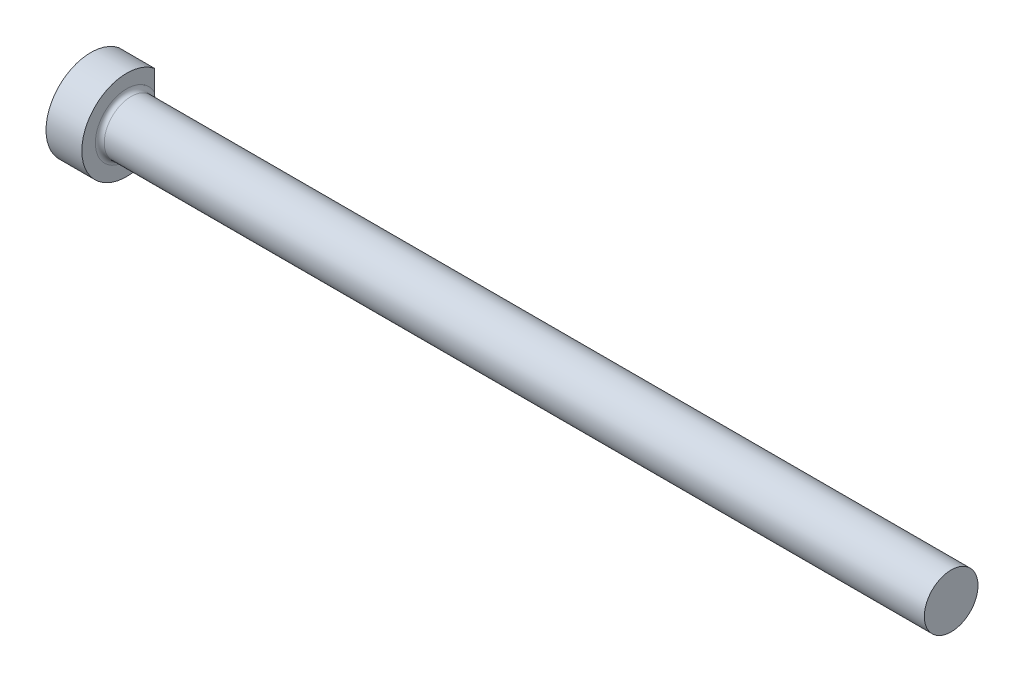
ISO-10303-21;
HEADER;
FILE_DESCRIPTION(('STEP AP214'),'2;1');
FILE_NAME('part.step','',(''),(''),'','','');
FILE_SCHEMA(('AUTOMOTIVE_DESIGN { 1 0 10303 214 1 1 1 1 }'));
ENDSEC;
DATA;
#1=APPLICATION_CONTEXT('core data for automotive mechanical design processes');
#2=APPLICATION_PROTOCOL_DEFINITION('international standard','automotive_design',2000,#1);
#3=PRODUCT_CONTEXT('',#1,'mechanical');
#4=PRODUCT('Part','Part','',(#3));
#5=PRODUCT_RELATED_PRODUCT_CATEGORY('part','',(#4));
#6=PRODUCT_DEFINITION_FORMATION('','',#4);
#7=PRODUCT_DEFINITION_CONTEXT('part definition',#1,'design');
#8=PRODUCT_DEFINITION('design','',#6,#7);
#9=PRODUCT_DEFINITION_SHAPE('','',#8);
#10=(LENGTH_UNIT() NAMED_UNIT(*) SI_UNIT(.MILLI.,.METRE.));
#11=(NAMED_UNIT(*) PLANE_ANGLE_UNIT() SI_UNIT($,.RADIAN.));
#12=(NAMED_UNIT(*) SI_UNIT($,.STERADIAN.) SOLID_ANGLE_UNIT());
#13=UNCERTAINTY_MEASURE_WITH_UNIT(LENGTH_MEASURE(1.E-05),#10,'distance_accuracy_value','');
#14=(GEOMETRIC_REPRESENTATION_CONTEXT(3) GLOBAL_UNCERTAINTY_ASSIGNED_CONTEXT((#13)) GLOBAL_UNIT_ASSIGNED_CONTEXT((#10,
#11,#12)) REPRESENTATION_CONTEXT('',''));
#15=CARTESIAN_POINT('',(0.,0.,0.));
#16=DIRECTION('',(0.,0.,1.));
#17=DIRECTION('',(1.,0.,0.));
#18=AXIS2_PLACEMENT_3D('',#15,#16,#17);
#19=CARTESIAN_POINT('',(0.,0.,0.));
#20=DIRECTION('',(1.,0.,0.));
#21=DIRECTION('',(0.,1.,0.));
#22=AXIS2_PLACEMENT_3D('',#19,#20,#21);
#23=PLANE('',#22);
#24=DIRECTION('',(0.,1.,0.));
#25=VECTOR('',#24,1.);
#26=CARTESIAN_POINT('',(0.,0.,-4.93395000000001));
#27=LINE('',#26,#25);
#28=CARTESIAN_POINT('',(0.,-6.21772013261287,-4.93395000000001));
#29=VERTEX_POINT('',#28);
#30=CARTESIAN_POINT('',(0.,6.21772013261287,-4.93395));
#31=VERTEX_POINT('',#30);
#32=EDGE_CURVE('E49',#29,#31,#27,.T.);
#33=ORIENTED_EDGE('',*,*,#32,.F.);
#34=CARTESIAN_POINT('',(0.,0.,0.));
#35=DIRECTION('',(-1.,0.,0.));
#36=DIRECTION('',(0.,-1.,0.));
#37=AXIS2_PLACEMENT_3D('',#34,#35,#36);
#38=CIRCLE('',#37,7.93749999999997);
#39=EDGE_CURVE('E43',#29,#31,#38,.T.);
#40=ORIENTED_EDGE('',*,*,#39,.T.);
#41=EDGE_LOOP('',(#33,#40));
#42=FACE_BOUND('',#41,.T.);
#43=ADVANCED_FACE('F32',(#42),#23,.F.);
#44=CARTESIAN_POINT('',(152.4,0.,0.));
#45=DIRECTION('',(-1.,0.,0.));
#46=DIRECTION('',(0.,-1.,0.));
#47=AXIS2_PLACEMENT_3D('',#44,#45,#46);
#48=CYLINDRICAL_SURFACE('',#47,7.93749999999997);
#49=DIRECTION('',(-1.,0.,0.));
#50=VECTOR('',#49,1.);
#51=CARTESIAN_POINT('',(152.4,-6.21772013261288,-4.93395000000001));
#52=LINE('',#51,#50);
#53=CARTESIAN_POINT('',(6.34999999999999,-6.21772013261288,-4.93395000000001));
#54=VERTEX_POINT('',#53);
#55=EDGE_CURVE('E87',#54,#29,#52,.T.);
#56=ORIENTED_EDGE('',*,*,#55,.F.);
#57=CARTESIAN_POINT('',(6.34999999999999,0.,0.));
#58=DIRECTION('',(-1.,0.,0.));
#59=DIRECTION('',(0.,-1.,0.));
#60=AXIS2_PLACEMENT_3D('',#57,#58,#59);
#61=CIRCLE('',#60,7.93749999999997);
#62=CARTESIAN_POINT('',(6.35,6.21772013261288,-4.93395));
#63=VERTEX_POINT('',#62);
#64=EDGE_CURVE('E75',#54,#63,#61,.T.);
#65=ORIENTED_EDGE('',*,*,#64,.T.);
#66=DIRECTION('',(-1.,0.,0.));
#67=VECTOR('',#66,1.);
#68=CARTESIAN_POINT('',(152.4,6.21772013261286,-4.93395));
#69=LINE('',#68,#67);
#70=EDGE_CURVE('E56',#31,#63,#69,.F.);
#71=ORIENTED_EDGE('',*,*,#70,.F.);
#72=ORIENTED_EDGE('',*,*,#39,.F.);
#73=EDGE_LOOP('',(#56,#65,#71,#72));
#74=FACE_BOUND('',#73,.T.);
#75=ADVANCED_FACE('F97',(#74),#48,.T.);
#76=CARTESIAN_POINT('',(6.35,7.93749999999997,0.));
#77=DIRECTION('',(-1.,0.,0.));
#78=DIRECTION('',(0.,-1.,0.));
#79=AXIS2_PLACEMENT_3D('',#76,#77,#78);
#80=PLANE('',#79);
#81=DIRECTION('',(0.,-1.,0.));
#82=VECTOR('',#81,1.);
#83=CARTESIAN_POINT('',(6.35,7.93749999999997,-4.93395));
#84=LINE('',#83,#82);
#85=CARTESIAN_POINT('',(6.34999999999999,2.5272680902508,-4.93395));
#86=VERTEX_POINT('',#85);
#87=EDGE_CURVE('E84',#63,#86,#84,.T.);
#88=ORIENTED_EDGE('',*,*,#87,.F.);
#89=ORIENTED_EDGE('',*,*,#64,.F.);
#90=CARTESIAN_POINT('',(6.35,-2.5272680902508,-4.93395000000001));
#91=VERTEX_POINT('',#90);
#92=EDGE_CURVE('E80',#91,#54,#84,.T.);
#93=ORIENTED_EDGE('',*,*,#92,.F.);
#94=CARTESIAN_POINT('',(6.34999999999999,0.,0.));
#95=DIRECTION('',(-1.,0.,0.));
#96=DIRECTION('',(0.,-1.,0.));
#97=AXIS2_PLACEMENT_3D('',#94,#95,#96);
#98=CIRCLE('',#97,5.54355);
#99=EDGE_CURVE('E70',#91,#86,#98,.T.);
#100=ORIENTED_EDGE('',*,*,#99,.T.);
#101=EDGE_LOOP('',(#88,#89,#93,#100));
#102=FACE_BOUND('',#101,.T.);
#103=ADVANCED_FACE('F81',(#102),#80,.F.);
#104=CARTESIAN_POINT('',(7.1374,0.,0.));
#105=DIRECTION('',(-1.,0.,0.));
#106=DIRECTION('',(0.,-1.,0.));
#107=AXIS2_PLACEMENT_3D('',#104,#105,#106);
#108=TOROIDAL_SURFACE('',#107,5.54355,0.7874);
#109=CARTESIAN_POINT('',(7.13739999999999,0.,0.));
#110=DIRECTION('',(-1.,0.,0.));
#111=DIRECTION('',(0.,-1.,0.));
#112=AXIS2_PLACEMENT_3D('',#109,#110,#111);
#113=CIRCLE('',#112,4.75615);
#114=CARTESIAN_POINT('',(7.13739999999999,-4.75615,0.));
#115=VERTEX_POINT('',#114);
#116=EDGE_CURVE('E76',#115,#115,#113,.T.);
#117=ORIENTED_EDGE('',*,*,#116,.T.);
#118=EDGE_LOOP('',(#117));
#119=FACE_BOUND('',#118,.T.);
#120=CARTESIAN_POINT('',(6.63901601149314,0.,-4.93395000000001));
#121=CARTESIAN_POINT('',(6.63901573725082,-0.0655924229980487,-4.93395000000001));
#122=CARTESIAN_POINT('',(6.63740024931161,-0.131185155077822,-4.93395000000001));
#123=CARTESIAN_POINT('',(6.63111964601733,-0.262224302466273,-4.93395000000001));
#124=CARTESIAN_POINT('',(6.6264543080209,-0.327670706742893,-4.93395000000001));
#125=CARTESIAN_POINT('',(6.60854776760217,-0.52384647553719,-4.93395000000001));
#126=CARTESIAN_POINT('',(6.59139845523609,-0.654205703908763,-4.93395000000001));
#127=CARTESIAN_POINT('',(6.55160775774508,-0.916304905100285,-4.93395000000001));
#128=CARTESIAN_POINT('',(6.52887607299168,-1.04802948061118,-4.93395000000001));
#129=CARTESIAN_POINT('',(6.4832326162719,-1.31132435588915,-4.93395000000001));
#130=CARTESIAN_POINT('',(6.46032103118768,-1.44289468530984,-4.93395000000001));
#131=CARTESIAN_POINT('',(6.41831019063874,-1.7075347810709,-4.93395000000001));
#132=CARTESIAN_POINT('',(6.39923581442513,-1.84060877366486,-4.93395000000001));
#133=CARTESIAN_POINT('',(6.36899641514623,-2.10794491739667,-4.93395000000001));
#134=CARTESIAN_POINT('',(6.35784503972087,-2.24220871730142,-4.93395000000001));
#135=CARTESIAN_POINT('',(6.34793677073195,-2.50930789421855,-4.93395000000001));
#136=CARTESIAN_POINT('',(6.34898926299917,-2.64213288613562,-4.93395000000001));
#137=CARTESIAN_POINT('',(6.36358073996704,-2.84022255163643,-4.93395000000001));
#138=CARTESIAN_POINT('',(6.3705931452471,-2.90596342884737,-4.93395000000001));
#139=CARTESIAN_POINT('',(6.3898258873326,-3.03666081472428,-4.93395000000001));
#140=CARTESIAN_POINT('',(6.40204140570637,-3.10161799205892,-4.93395000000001));
#141=CARTESIAN_POINT('',(6.42561983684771,-3.20023654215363,-4.93395000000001));
#142=CARTESIAN_POINT('',(6.43474813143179,-3.23443338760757,-4.93395000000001));
#143=CARTESIAN_POINT('',(6.455006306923,-3.30223001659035,-4.93395000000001));
#144=CARTESIAN_POINT('',(6.46613664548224,-3.33582966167,-4.93395000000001));
#145=CARTESIAN_POINT('',(6.50286270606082,-3.43544522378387,-4.93395000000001));
#146=CARTESIAN_POINT('',(6.53180356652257,-3.50032283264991,-4.93395000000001));
#147=CARTESIAN_POINT('',(6.58966480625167,-3.60450577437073,-4.93395000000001));
#148=CARTESIAN_POINT('',(6.61569797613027,-3.64541034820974,-4.93395000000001));
#149=CARTESIAN_POINT('',(6.67353108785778,-3.72295892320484,-4.93395000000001));
#150=CARTESIAN_POINT('',(6.70532160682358,-3.7596097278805,-4.93395000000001));
#151=CARTESIAN_POINT('',(6.76578876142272,-3.81756907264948,-4.93395000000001));
#152=CARTESIAN_POINT('',(6.79303425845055,-3.84036234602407,-4.93395000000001));
#153=CARTESIAN_POINT('',(6.85080647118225,-3.88134722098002,-4.93395000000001));
#154=CARTESIAN_POINT('',(6.88132865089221,-3.89954506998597,-4.93395000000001));
#155=CARTESIAN_POINT('',(6.93980418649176,-3.92748117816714,-4.93395000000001));
#156=CARTESIAN_POINT('',(6.96732026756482,-3.93812925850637,-4.93395000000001));
#157=CARTESIAN_POINT('',(7.02375341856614,-3.95467346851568,-4.93395000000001));
#158=CARTESIAN_POINT('',(7.05266962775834,-3.96057247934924,-4.93395000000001));
#159=CARTESIAN_POINT('',(7.1112000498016,-3.96717707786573,-4.93395000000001));
#160=CARTESIAN_POINT('',(7.14081633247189,-3.96786461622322,-4.93395000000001));
#161=CARTESIAN_POINT('',(7.19969379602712,-3.96394043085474,-4.93395000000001));
#162=CARTESIAN_POINT('',(7.22895493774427,-3.95932812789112,-4.93395000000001));
#163=CARTESIAN_POINT('',(7.28475066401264,-3.94554575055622,-4.93395000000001));
#164=CARTESIAN_POINT('',(7.31134794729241,-3.93662450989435,-4.93395000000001));
#165=CARTESIAN_POINT('',(7.36289955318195,-3.91491589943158,-4.93395000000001));
#166=CARTESIAN_POINT('',(7.38785326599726,-3.90212710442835,-4.93395000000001));
#167=CARTESIAN_POINT('',(7.44611804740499,-3.86711906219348,-4.93395000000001));
#168=CARTESIAN_POINT('',(7.47841331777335,-3.8432088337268,-4.93395000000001));
#169=CARTESIAN_POINT('',(7.53874770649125,-3.7905186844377,-4.93395000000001));
#170=CARTESIAN_POINT('',(7.56677713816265,-3.76172798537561,-4.93395000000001));
#171=CARTESIAN_POINT('',(7.6314899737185,-3.6856803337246,-4.93395000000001));
#172=CARTESIAN_POINT('',(7.6656618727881,-3.63629902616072,-4.93395000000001));
#173=CARTESIAN_POINT('',(7.72605933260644,-3.53294055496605,-4.93395000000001));
#174=CARTESIAN_POINT('',(7.75226856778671,-3.47895423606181,-4.93395000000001));
#175=CARTESIAN_POINT('',(7.79467798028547,-3.37622762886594,-4.93395000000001));
#176=CARTESIAN_POINT('',(7.81177536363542,-3.32784877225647,-4.93395000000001));
#177=CARTESIAN_POINT('',(7.84173487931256,-3.22978212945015,-4.93395000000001));
#178=CARTESIAN_POINT('',(7.85459383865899,-3.18009339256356,-4.93395000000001));
#179=CARTESIAN_POINT('',(7.88772653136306,-3.02973796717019,-4.93395000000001));
#180=CARTESIAN_POINT('',(7.90252562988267,-2.92786262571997,-4.93395000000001));
#181=CARTESIAN_POINT('',(7.92021387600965,-2.73389814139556,-4.93395000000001));
#182=CARTESIAN_POINT('',(7.92417788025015,-2.64188834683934,-4.93395000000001));
#183=CARTESIAN_POINT('',(7.92528678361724,-2.45777432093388,-4.93395000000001));
#184=CARTESIAN_POINT('',(7.92242611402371,-2.36567007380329,-4.93395000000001));
#185=CARTESIAN_POINT('',(7.91146162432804,-2.18153550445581,-4.93395000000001));
#186=CARTESIAN_POINT('',(7.90334239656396,-2.08950619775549,-4.93395000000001));
#187=CARTESIAN_POINT('',(7.88324256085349,-1.90592934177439,-4.93395000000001));
#188=CARTESIAN_POINT('',(7.87126371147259,-1.81438159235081,-4.93395000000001));
#189=CARTESIAN_POINT('',(7.83905908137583,-1.59263852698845,-4.93395000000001));
#190=CARTESIAN_POINT('',(7.81749654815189,-1.46264436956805,-4.93395000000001));
#191=CARTESIAN_POINT('',(7.77291274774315,-1.20282880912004,-4.93395000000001));
#192=CARTESIAN_POINT('',(7.74989035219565,-1.07300762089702,-4.93395000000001));
#193=CARTESIAN_POINT('',(7.70707425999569,-0.813855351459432,-4.93395000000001));
#194=CARTESIAN_POINT('',(7.68725589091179,-0.684528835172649,-4.93395000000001));
#195=CARTESIAN_POINT('',(7.66370485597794,-0.48984019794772,-4.93395000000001));
#196=CARTESIAN_POINT('',(7.65688618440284,-0.424866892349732,-4.93395000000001));
#197=CARTESIAN_POINT('',(7.64589614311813,-0.29470093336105,-4.93395000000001));
#198=CARTESIAN_POINT('',(7.64172448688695,-0.229508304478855,-4.93395000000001));
#199=CARTESIAN_POINT('',(7.6348470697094,-0.0579455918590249,-4.93395000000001));
#200=CARTESIAN_POINT('',(7.63471191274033,0.0485439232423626,-4.93395000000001));
#201=CARTESIAN_POINT('',(7.64277291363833,0.261242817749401,-4.93395000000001));
#202=CARTESIAN_POINT('',(7.65097464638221,0.367451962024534,-4.93395000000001));
#203=CARTESIAN_POINT('',(7.67363148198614,0.579785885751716,-4.93395000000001));
#204=CARTESIAN_POINT('',(7.68812341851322,0.68590642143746,-4.93395000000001));
#205=CARTESIAN_POINT('',(7.72045275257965,0.897608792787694,-4.93395000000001));
#206=CARTESIAN_POINT('',(7.73829030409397,1.00319060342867,-4.93395000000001));
#207=CARTESIAN_POINT('',(7.77245867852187,1.20146021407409,-4.93395000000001));
#208=CARTESIAN_POINT('',(7.78871047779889,1.29416156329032,-4.93395000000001));
#209=CARTESIAN_POINT('',(7.82020436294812,1.47972458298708,-4.93395000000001));
#210=CARTESIAN_POINT('',(7.8354464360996,1.57258625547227,-4.93395000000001));
#211=CARTESIAN_POINT('',(7.87757838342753,1.85165110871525,-4.93395000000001));
#212=CARTESIAN_POINT('',(7.90090970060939,2.03850922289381,-4.93395000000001));
#213=CARTESIAN_POINT('',(7.91922810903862,2.30337566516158,-4.93395000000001));
#214=CARTESIAN_POINT('',(7.92281516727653,2.38075487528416,-4.93395));
#215=CARTESIAN_POINT('',(7.92555125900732,2.5355782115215,-4.93395));
#216=CARTESIAN_POINT('',(7.92470217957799,2.61302229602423,-4.93395));
#217=CARTESIAN_POINT('',(7.91751349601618,2.76742769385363,-4.93395));
#218=CARTESIAN_POINT('',(7.9111916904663,2.84438975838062,-4.93395));
#219=CARTESIAN_POINT('',(7.89178834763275,2.99742493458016,-4.93395));
#220=CARTESIAN_POINT('',(7.87871483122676,3.073498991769,-4.93395));
#221=CARTESIAN_POINT('',(7.84862010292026,3.2043803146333,-4.93395));
#222=CARTESIAN_POINT('',(7.83348451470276,3.2596158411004,-4.93395));
#223=CARTESIAN_POINT('',(7.79771103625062,3.36839003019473,-4.93395));
#224=CARTESIAN_POINT('',(7.77706713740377,3.42192676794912,-4.93395));
#225=CARTESIAN_POINT('',(7.72906476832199,3.52656170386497,-4.93395));
#226=CARTESIAN_POINT('',(7.7016458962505,3.57763273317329,-4.93395));
#227=CARTESIAN_POINT('',(7.63904101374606,3.67480444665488,-4.93395));
#228=CARTESIAN_POINT('',(7.60387483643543,3.7209173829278,-4.93395));
#229=CARTESIAN_POINT('',(7.53992162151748,3.78897378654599,-4.93395));
#230=CARTESIAN_POINT('',(7.51381446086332,3.81342902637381,-4.93395));
#231=CARTESIAN_POINT('',(7.4582115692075,3.85815319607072,-4.93395));
#232=CARTESIAN_POINT('',(7.42871986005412,3.87842701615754,-4.93395));
#233=CARTESIAN_POINT('',(7.37121776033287,3.91092407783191,-4.93395));
#234=CARTESIAN_POINT('',(7.34363296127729,3.92389439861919,-4.93395));
#235=CARTESIAN_POINT('',(7.28667615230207,3.94505953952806,-4.93395));
#236=CARTESIAN_POINT('',(7.25730526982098,3.9532573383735,-4.93395));
#237=CARTESIAN_POINT('',(7.19739647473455,3.96427326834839,-4.93395));
#238=CARTESIAN_POINT('',(7.16685329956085,3.9670632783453,-4.93395));
#239=CARTESIAN_POINT('',(7.1057814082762,3.96692837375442,-4.93395));
#240=CARTESIAN_POINT('',(7.07525269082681,3.96400418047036,-4.93395));
#241=CARTESIAN_POINT('',(7.01780900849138,3.95319045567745,-4.93395));
#242=CARTESIAN_POINT('',(6.99080798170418,3.94574595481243,-4.93395));
#243=CARTESIAN_POINT('',(6.93828352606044,3.9267973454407,-4.93395));
#244=CARTESIAN_POINT('',(6.91276059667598,3.91529187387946,-4.93395));
#245=CARTESIAN_POINT('',(6.85454217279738,3.88397282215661,-4.93395));
#246=CARTESIAN_POINT('',(6.82265386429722,3.86265984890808,-4.93395));
#247=CARTESIAN_POINT('',(6.7627403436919,3.81516833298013,-4.93395));
#248=CARTESIAN_POINT('',(6.73472307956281,3.78898003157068,-4.93395));
#249=CARTESIAN_POINT('',(6.67044858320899,3.72014409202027,-4.93395));
#250=CARTESIAN_POINT('',(6.63636257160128,3.67548108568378,-4.93395));
#251=CARTESIAN_POINT('',(6.57546813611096,3.58147359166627,-4.93395));
#252=CARTESIAN_POINT('',(6.5486753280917,3.53211935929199,-4.93395));
#253=CARTESIAN_POINT('',(6.50515558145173,3.43871476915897,-4.93395));
#254=CARTESIAN_POINT('',(6.48750310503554,3.39508563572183,-4.93395));
#255=CARTESIAN_POINT('',(6.45603507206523,3.3064504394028,-4.93395));
#256=CARTESIAN_POINT('',(6.44222226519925,3.26144341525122,-4.93395));
#257=CARTESIAN_POINT('',(6.40578944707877,3.12507206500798,-4.93395));
#258=CARTESIAN_POINT('',(6.38818053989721,3.03237022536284,-4.93395));
#259=CARTESIAN_POINT('',(6.35994639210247,2.8216720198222,-4.93395));
#260=CARTESIAN_POINT('',(6.35229306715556,2.70331748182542,-4.93395));
#261=CARTESIAN_POINT('',(6.34859730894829,2.46632693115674,-4.93395));
#262=CARTESIAN_POINT('',(6.35257795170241,2.34769082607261,-4.93395000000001));
#263=CARTESIAN_POINT('',(6.36887394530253,2.11003318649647,-4.93395000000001));
#264=CARTESIAN_POINT('',(6.38126077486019,1.99101713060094,-4.93395000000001));
#265=CARTESIAN_POINT('',(6.41150512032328,1.75382719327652,-4.93395000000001));
#266=CARTESIAN_POINT('',(6.42935808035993,1.63565269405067,-4.93395000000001));
#267=CARTESIAN_POINT('',(6.46921569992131,1.39087192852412,-4.93395000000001));
#268=CARTESIAN_POINT('',(6.49143190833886,1.2643017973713,-4.93395000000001));
#269=CARTESIAN_POINT('',(6.53523465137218,1.01096063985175,-4.93395000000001));
#270=CARTESIAN_POINT('',(6.55682073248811,0.884189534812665,-4.93395000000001));
#271=CARTESIAN_POINT('',(6.59443560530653,0.631540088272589,-4.93395000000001));
#272=CARTESIAN_POINT('',(6.6105376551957,0.505673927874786,-4.93395000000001));
#273=CARTESIAN_POINT('',(6.62729847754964,0.316291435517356,-4.93395000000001));
#274=CARTESIAN_POINT('',(6.63165289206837,0.253112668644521,-4.93395000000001));
#275=CARTESIAN_POINT('',(6.63751170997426,0.126622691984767,-4.93395000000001));
#276=CARTESIAN_POINT('',(6.63901627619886,0.063311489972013,-4.93395000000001));
#277=CARTESIAN_POINT('',(6.63901601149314,0.,-4.93395000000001));
#278=B_SPLINE_CURVE_WITH_KNOTS('',3,(#120,#121,#122,#123,#124,#125,#126,#127,#128,#129,#130,
#131,#132,#133,#134,#135,#136,#137,#138,#139,#140,#141,#142,#143,#144,#145,#146,#147,#148,#149,
#150,#151,#152,#153,#154,#155,#156,#157,#158,#159,#160,#161,#162,#163,#164,#165,#166,#167,#168,
#169,#170,#171,#172,#173,#174,#175,#176,#177,#178,#179,#180,#181,#182,#183,#184,#185,#186,#187,
#188,#189,#190,#191,#192,#193,#194,#195,#196,#197,#198,#199,#200,#201,#202,#203,#204,#205,#206,
#207,#208,#209,#210,#211,#212,#213,#214,#215,#216,#217,#218,#219,#220,#221,#222,#223,#224,#225,
#226,#227,#228,#229,#230,#231,#232,#233,#234,#235,#236,#237,#238,#239,#240,#241,#242,#243,#244,
#245,#246,#247,#248,#249,#250,#251,#252,#253,#254,#255,#256,#257,#258,#259,#260,#261,#262,#263,
#264,#265,#266,#267,#268,#269,#270,#271,#272,#273,#274,#275,#276,#277),.UNSPECIFIED.,.T.,.F.,(4,
2,2,2,2,2,2,2,2,2,2,2,2,2,2,2,2,2,2,2,2,2,2,2,2,2,2,2,2,2,2,2,2,2,2,2,2,2,2,2,2,2,2,2,2,2,2,2,2,
2,2,2,2,2,2,2,2,2,2,2,2,2,2,2,2,2,2,2,2,2,2,2,2,2,2,2,2,2,4),(0.,0.196759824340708,
0.393534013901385,0.787700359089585,1.18871953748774,1.58936623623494,1.99253234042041,
2.39639123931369,2.79395080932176,2.99213721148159,3.19014047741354,3.29626503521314,
3.40241388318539,3.61457387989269,3.75964763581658,3.90448606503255,4.0106920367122,
4.11675283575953,4.20489398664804,4.29298162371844,4.38137420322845,4.46977644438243,
4.55359303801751,4.63744055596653,4.75731381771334,4.87745534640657,5.05660699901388,
5.23612351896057,5.38983502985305,5.54366135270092,5.85156960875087,6.12758470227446,
6.40382509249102,6.68087855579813,6.95780596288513,7.35306439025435,7.74863213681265,
8.14099156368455,8.33693514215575,8.53285750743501,8.85195893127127,9.17127387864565,
9.49248441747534,9.81370974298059,10.096046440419,10.3783866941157,10.942531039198,
11.1748175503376,11.4070052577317,11.6384406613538,11.8696017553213,12.041190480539,
12.2129671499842,12.3863343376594,12.5592627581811,12.6662582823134,12.7731279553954,
12.8641980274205,12.9552111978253,13.0466963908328,13.1381700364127,13.2218374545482,
13.3055329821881,13.4199582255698,13.5346150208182,13.7022300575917,13.8702012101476,
14.0111951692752,14.1522898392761,14.4345204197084,14.7895315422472,15.1452473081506,
15.5040263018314,15.8625070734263,16.248019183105,16.6338022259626,17.0142086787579,
17.2041371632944,17.3940547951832),.UNSPECIFIED.);
#279=EDGE_CURVE('E12',#86,#91,#278,.T.);
#280=ORIENTED_EDGE('',*,*,#279,.F.);
#281=ORIENTED_EDGE('',*,*,#99,.F.);
#282=EDGE_LOOP('',(#280,#281));
#283=FACE_BOUND('',#282,.T.);
#284=ADVANCED_FACE('F72',(#119,#283),#108,.F.);
#285=CARTESIAN_POINT('',(152.4,0.,0.));
#286=DIRECTION('',(-1.,0.,0.));
#287=DIRECTION('',(0.,-1.,0.));
#288=AXIS2_PLACEMENT_3D('',#285,#286,#287);
#289=CYLINDRICAL_SURFACE('',#288,4.75615000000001);
#290=ORIENTED_EDGE('',*,*,#116,.F.);
#291=EDGE_LOOP('',(#290));
#292=FACE_BOUND('',#291,.T.);
#293=CARTESIAN_POINT('',(152.4,0.,0.));
#294=DIRECTION('',(-1.,0.,0.));
#295=DIRECTION('',(0.,-1.,0.));
#296=AXIS2_PLACEMENT_3D('',#293,#294,#295);
#297=CIRCLE('',#296,4.75615000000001);
#298=CARTESIAN_POINT('',(152.4,-4.75615000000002,0.));
#299=VERTEX_POINT('',#298);
#300=EDGE_CURVE('E92',#299,#299,#297,.T.);
#301=ORIENTED_EDGE('',*,*,#300,.T.);
#302=EDGE_LOOP('',(#301));
#303=FACE_BOUND('',#302,.T.);
#304=ADVANCED_FACE('F107',(#292,#303),#289,.T.);
#305=CARTESIAN_POINT('',(152.4,4.75615,0.));
#306=DIRECTION('',(-1.,0.,0.));
#307=DIRECTION('',(0.,-1.,0.));
#308=AXIS2_PLACEMENT_3D('',#305,#306,#307);
#309=PLANE('',#308);
#310=ORIENTED_EDGE('',*,*,#300,.F.);
#311=EDGE_LOOP('',(#310));
#312=FACE_BOUND('',#311,.T.);
#313=ADVANCED_FACE('F111',(#312),#309,.F.);
#314=CARTESIAN_POINT('',(0.,0.,-4.93395000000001));
#315=DIRECTION('',(0.,0.,-1.));
#316=DIRECTION('',(0.,1.,0.));
#317=AXIS2_PLACEMENT_3D('',#314,#315,#316);
#318=PLANE('',#317);
#319=ORIENTED_EDGE('',*,*,#55,.T.);
#320=ORIENTED_EDGE('',*,*,#32,.T.);
#321=ORIENTED_EDGE('',*,*,#70,.T.);
#322=ORIENTED_EDGE('',*,*,#87,.T.);
#323=ORIENTED_EDGE('',*,*,#279,.T.);
#324=ORIENTED_EDGE('',*,*,#92,.T.);
#325=EDGE_LOOP('',(#319,#320,#321,#322,#323,#324));
#326=FACE_BOUND('',#325,.T.);
#327=ADVANCED_FACE('F86',(#326),#318,.T.);
#328=CLOSED_SHELL('',(#43,#75,#103,#284,#304,#313,#327));
#329=MANIFOLD_SOLID_BREP('B2',#328);
#330=ADVANCED_BREP_SHAPE_REPRESENTATION('',(#18,#329),#14);
#331=SHAPE_DEFINITION_REPRESENTATION(#9,#330);
ENDSEC;
END-ISO-10303-21;
